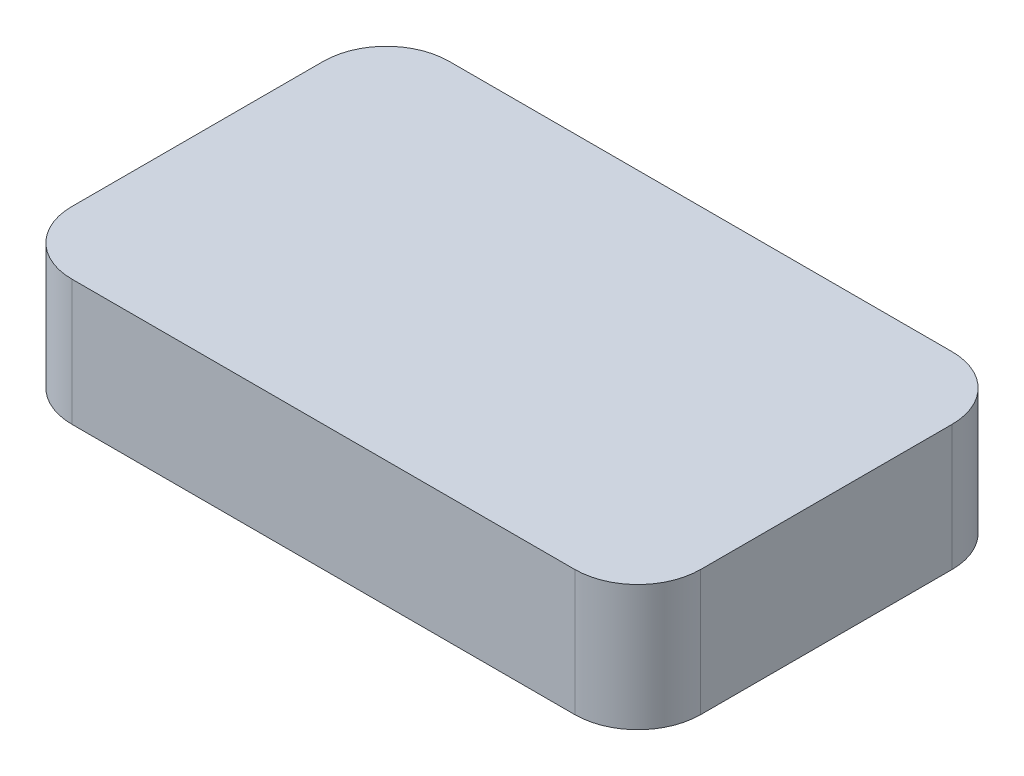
from build123d import *

# Parameters (mm, degrees)
SKETCH_1_W      = 50
SKETCH_1_H      = 30
EXTRUDE_1_DEPTH = 10
FILLET_2_R      = 5


with BuildPart() as part:
    # Sketch 1 → Extrude 1 (new body)
    with BuildSketch(Plane(origin=(0, 0, 0), x_dir=(1, 0, 0), z_dir=(0, 1, 0))):
        Rectangle(SKETCH_1_W, SKETCH_1_H)
    extrude(amount=EXTRUDE_1_DEPTH)

    # Fillet 2
    fillet_2_edges = [part.edges().sort_by_distance(p)[0] for p in [
        (25, 5, 15),
        (-25, 5, 15),
        (-25, 5, -15),
        (25, 5, -15),
    ]]
    fillet(fillet_2_edges, radius=FILLET_2_R)


solid = part.part
